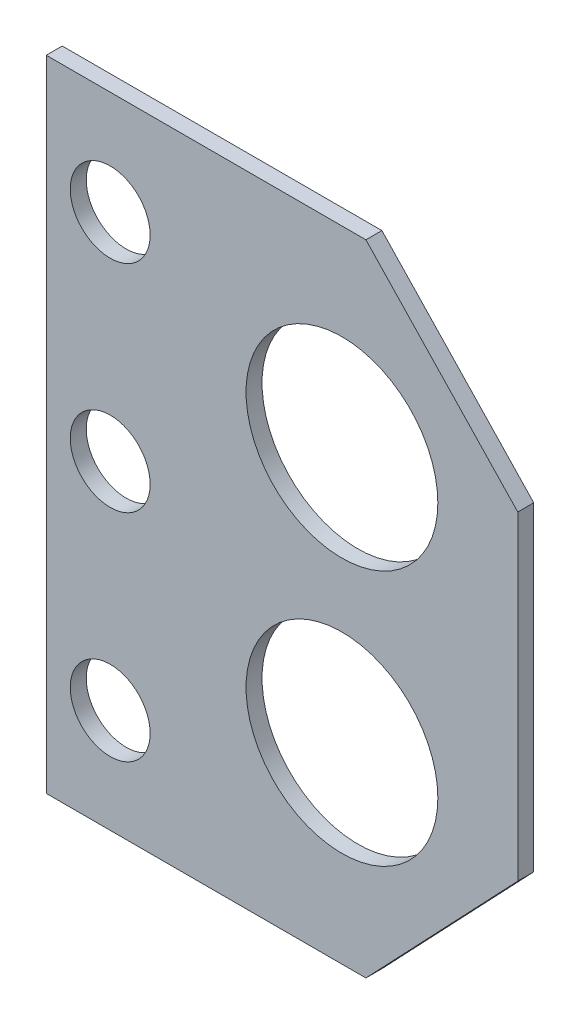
from build123d import *

# Parameters (mm, degrees)
BOSS_EXTRU_1_DEPTH      = 10
ESQUISSE2_R             = 25
ESQUISSE2_R_2           = 60
ENL_V_MAT_EXTRU_1_DEPTH = 498.116686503


with BuildPart() as part:
    # Esquisse1 → Boss.-Extru.1 (new body)
    with BuildSketch(Plane.XY):
        Polygon((0, 0), (0, 400), (200, 400), (295, 300), (295, 100), (200, 0), align=None)
    extrude(amount=BOSS_EXTRU_1_DEPTH)

    # Esquisse2 → Enl_v. mat.-Extru.1 (cut, through all)
    with BuildSketch(Plane.XY.offset(10)):
        with Locations((40, 335)):
            Circle(ESQUISSE2_R)
        with Locations((40, 200)):
            Circle(ESQUISSE2_R)
        with Locations((40, 65)):
            Circle(ESQUISSE2_R)
        with Locations((185, 280)):
            Circle(ESQUISSE2_R_2)
        with Locations((185, 120)):
            Circle(ESQUISSE2_R_2)
    extrude(amount=-ENL_V_MAT_EXTRU_1_DEPTH, mode=Mode.SUBTRACT)


solid = part.part
